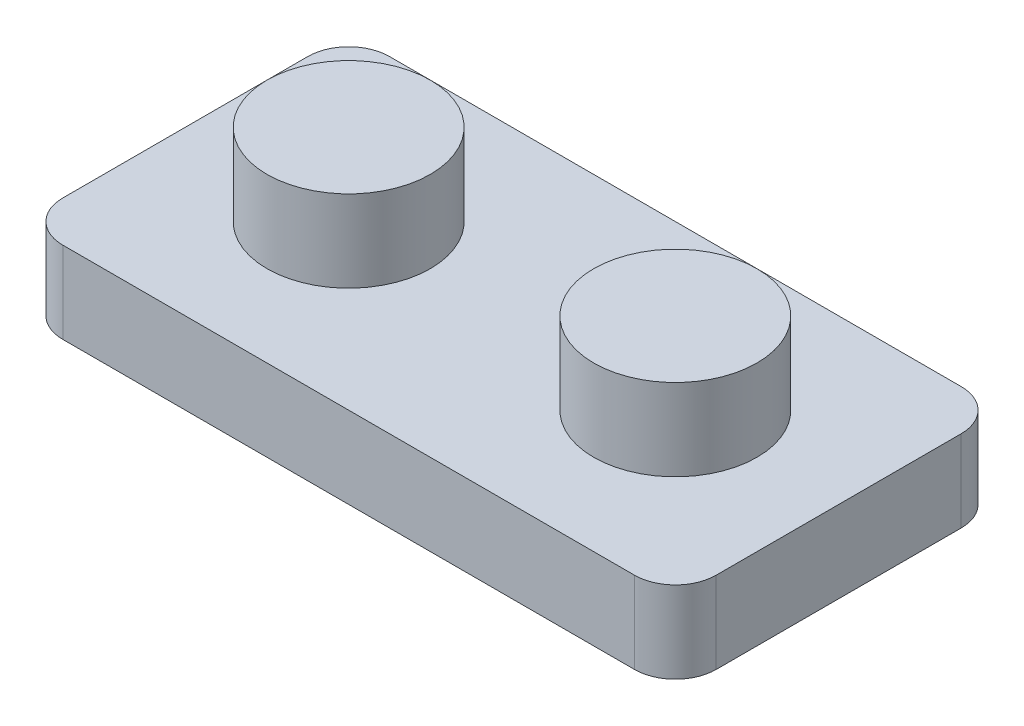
ISO-10303-21;
HEADER;
FILE_DESCRIPTION(('STEP AP214'),'2;1');
FILE_NAME('part.step','',(''),(''),'','','');
FILE_SCHEMA(('AUTOMOTIVE_DESIGN { 1 0 10303 214 1 1 1 1 }'));
ENDSEC;
DATA;
#1=APPLICATION_CONTEXT('core data for automotive mechanical design processes');
#2=APPLICATION_PROTOCOL_DEFINITION('international standard','automotive_design',2000,#1);
#3=PRODUCT_CONTEXT('',#1,'mechanical');
#4=PRODUCT('Part','Part','',(#3));
#5=PRODUCT_RELATED_PRODUCT_CATEGORY('part','',(#4));
#6=PRODUCT_DEFINITION_FORMATION('','',#4);
#7=PRODUCT_DEFINITION_CONTEXT('part definition',#1,'design');
#8=PRODUCT_DEFINITION('design','',#6,#7);
#9=PRODUCT_DEFINITION_SHAPE('','',#8);
#10=(LENGTH_UNIT() NAMED_UNIT(*) SI_UNIT(.MILLI.,.METRE.));
#11=(NAMED_UNIT(*) PLANE_ANGLE_UNIT() SI_UNIT($,.RADIAN.));
#12=(NAMED_UNIT(*) SI_UNIT($,.STERADIAN.) SOLID_ANGLE_UNIT());
#13=UNCERTAINTY_MEASURE_WITH_UNIT(LENGTH_MEASURE(1.E-05),#10,'distance_accuracy_value','');
#14=(GEOMETRIC_REPRESENTATION_CONTEXT(3) GLOBAL_UNCERTAINTY_ASSIGNED_CONTEXT((#13)) GLOBAL_UNIT_ASSIGNED_CONTEXT((#10,
#11,#12)) REPRESENTATION_CONTEXT('',''));
#15=CARTESIAN_POINT('',(0.,0.,0.));
#16=DIRECTION('',(0.,0.,1.));
#17=DIRECTION('',(1.,0.,0.));
#18=AXIS2_PLACEMENT_3D('',#15,#16,#17);
#19=CARTESIAN_POINT('',(0.,12.7,-50.8));
#20=DIRECTION('',(0.,-1.,0.));
#21=DIRECTION('',(0.,0.,-1.));
#22=AXIS2_PLACEMENT_3D('',#19,#20,#21);
#23=PLANE('',#22);
#24=CARTESIAN_POINT('',(25.4,12.7,-25.4));
#25=DIRECTION('',(0.,-1.,0.));
#26=DIRECTION('',(0.,0.,-1.));
#27=AXIS2_PLACEMENT_3D('',#24,#25,#26);
#28=CIRCLE('',#27,12.7);
#29=CARTESIAN_POINT('',(25.4,12.7,-38.1));
#30=VERTEX_POINT('',#29);
#31=EDGE_CURVE('E133',#30,#30,#28,.F.);
#32=ORIENTED_EDGE('',*,*,#31,.F.);
#33=EDGE_LOOP('',(#32));
#34=FACE_BOUND('',#33,.T.);
#35=DIRECTION('',(1.,0.,0.));
#36=VECTOR('',#35,1.);
#37=CARTESIAN_POINT('',(0.,12.7,0.));
#38=LINE('',#37,#36);
#39=CARTESIAN_POINT('',(6.35,12.7,0.));
#40=VERTEX_POINT('',#39);
#41=CARTESIAN_POINT('',(95.25,12.7,0.));
#42=VERTEX_POINT('',#41);
#43=EDGE_CURVE('E172',#40,#42,#38,.T.);
#44=ORIENTED_EDGE('',*,*,#43,.T.);
#45=CARTESIAN_POINT('',(95.25,12.7,-6.35));
#46=DIRECTION('',(0.,-1.,0.));
#47=DIRECTION('',(0.,0.,-1.));
#48=AXIS2_PLACEMENT_3D('',#45,#46,#47);
#49=CIRCLE('',#48,6.35);
#50=CARTESIAN_POINT('',(101.6,12.7,-6.35));
#51=VERTEX_POINT('',#50);
#52=EDGE_CURVE('E153',#42,#51,#49,.F.);
#53=ORIENTED_EDGE('',*,*,#52,.T.);
#54=DIRECTION('',(0.,0.,-1.));
#55=VECTOR('',#54,1.);
#56=CARTESIAN_POINT('',(101.6,12.7,0.));
#57=LINE('',#56,#55);
#58=CARTESIAN_POINT('',(101.6,12.7,-44.45));
#59=VERTEX_POINT('',#58);
#60=EDGE_CURVE('E118',#51,#59,#57,.T.);
#61=ORIENTED_EDGE('',*,*,#60,.T.);
#62=CARTESIAN_POINT('',(95.25,12.7,-44.45));
#63=DIRECTION('',(0.,-1.,0.));
#64=DIRECTION('',(0.,0.,-1.));
#65=AXIS2_PLACEMENT_3D('',#62,#63,#64);
#66=CIRCLE('',#65,6.35);
#67=CARTESIAN_POINT('',(95.25,12.7,-50.8));
#68=VERTEX_POINT('',#67);
#69=EDGE_CURVE('E54',#59,#68,#66,.F.);
#70=ORIENTED_EDGE('',*,*,#69,.T.);
#71=DIRECTION('',(-1.,0.,0.));
#72=VECTOR('',#71,1.);
#73=CARTESIAN_POINT('',(0.,12.7,-50.8));
#74=LINE('',#73,#72);
#75=CARTESIAN_POINT('',(6.35,12.7,-50.8));
#76=VERTEX_POINT('',#75);
#77=EDGE_CURVE('E137',#68,#76,#74,.T.);
#78=ORIENTED_EDGE('',*,*,#77,.T.);
#79=CARTESIAN_POINT('',(6.35,12.7,-44.45));
#80=DIRECTION('',(0.,-1.,0.));
#81=DIRECTION('',(0.,0.,-1.));
#82=AXIS2_PLACEMENT_3D('',#79,#80,#81);
#83=CIRCLE('',#82,6.35);
#84=CARTESIAN_POINT('',(0.,12.7,-44.45));
#85=VERTEX_POINT('',#84);
#86=EDGE_CURVE('E150',#76,#85,#83,.F.);
#87=ORIENTED_EDGE('',*,*,#86,.T.);
#88=DIRECTION('',(0.,0.,1.));
#89=VECTOR('',#88,1.);
#90=CARTESIAN_POINT('',(0.,12.7,0.));
#91=LINE('',#90,#89);
#92=CARTESIAN_POINT('',(0.,12.7,-6.35));
#93=VERTEX_POINT('',#92);
#94=EDGE_CURVE('E127',#85,#93,#91,.T.);
#95=ORIENTED_EDGE('',*,*,#94,.T.);
#96=CARTESIAN_POINT('',(6.35,12.7,-6.35));
#97=DIRECTION('',(0.,-1.,0.));
#98=DIRECTION('',(0.,0.,-1.));
#99=AXIS2_PLACEMENT_3D('',#96,#97,#98);
#100=CIRCLE('',#99,6.35);
#101=EDGE_CURVE('E148',#93,#40,#100,.F.);
#102=ORIENTED_EDGE('',*,*,#101,.T.);
#103=EDGE_LOOP('',(#44,#53,#61,#70,#78,#87,#95,#102));
#104=FACE_BOUND('',#103,.T.);
#105=CARTESIAN_POINT('',(76.2,12.7,-25.4));
#106=DIRECTION('',(0.,-1.,0.));
#107=DIRECTION('',(0.,0.,-1.));
#108=AXIS2_PLACEMENT_3D('',#105,#106,#107);
#109=CIRCLE('',#108,12.7);
#110=CARTESIAN_POINT('',(76.2,12.7,-38.1));
#111=VERTEX_POINT('',#110);
#112=EDGE_CURVE('E136',#111,#111,#109,.F.);
#113=ORIENTED_EDGE('',*,*,#112,.F.);
#114=EDGE_LOOP('',(#113));
#115=FACE_BOUND('',#114,.T.);
#116=ADVANCED_FACE('F32',(#34,#104,#115),#23,.F.);
#117=CARTESIAN_POINT('',(0.,12.7,0.));
#118=DIRECTION('',(1.,0.,0.));
#119=DIRECTION('',(0.,0.,-1.));
#120=AXIS2_PLACEMENT_3D('',#117,#118,#119);
#121=PLANE('',#120);
#122=ORIENTED_EDGE('',*,*,#94,.F.);
#123=DIRECTION('',(0.,-1.,0.));
#124=VECTOR('',#123,1.);
#125=CARTESIAN_POINT('',(0.,12.7,-44.45));
#126=LINE('',#125,#124);
#127=CARTESIAN_POINT('',(0.,0.,-44.45));
#128=VERTEX_POINT('',#127);
#129=EDGE_CURVE('E11',#85,#128,#126,.T.);
#130=ORIENTED_EDGE('',*,*,#129,.T.);
#131=DIRECTION('',(0.,0.,1.));
#132=VECTOR('',#131,1.);
#133=CARTESIAN_POINT('',(0.,0.,0.));
#134=LINE('',#133,#132);
#135=CARTESIAN_POINT('',(0.,0.,-6.35));
#136=VERTEX_POINT('',#135);
#137=EDGE_CURVE('E129',#128,#136,#134,.T.);
#138=ORIENTED_EDGE('',*,*,#137,.T.);
#139=DIRECTION('',(0.,-1.,0.));
#140=VECTOR('',#139,1.);
#141=CARTESIAN_POINT('',(0.,12.7,-6.35));
#142=LINE('',#141,#140);
#143=EDGE_CURVE('E40',#136,#93,#142,.F.);
#144=ORIENTED_EDGE('',*,*,#143,.T.);
#145=EDGE_LOOP('',(#122,#130,#138,#144));
#146=FACE_BOUND('',#145,.T.);
#147=ADVANCED_FACE('F163',(#146),#121,.F.);
#148=CARTESIAN_POINT('',(0.,12.7,0.));
#149=DIRECTION('',(0.,0.,-1.));
#150=DIRECTION('',(-1.,0.,0.));
#151=AXIS2_PLACEMENT_3D('',#148,#149,#150);
#152=PLANE('',#151);
#153=DIRECTION('',(1.,0.,0.));
#154=VECTOR('',#153,1.);
#155=CARTESIAN_POINT('',(0.,0.,0.));
#156=LINE('',#155,#154);
#157=CARTESIAN_POINT('',(6.35,0.,0.));
#158=VERTEX_POINT('',#157);
#159=CARTESIAN_POINT('',(95.25,0.,0.));
#160=VERTEX_POINT('',#159);
#161=EDGE_CURVE('E125',#158,#160,#156,.T.);
#162=ORIENTED_EDGE('',*,*,#161,.T.);
#163=DIRECTION('',(0.,-1.,0.));
#164=VECTOR('',#163,1.);
#165=CARTESIAN_POINT('',(95.25,12.7,0.));
#166=LINE('',#165,#164);
#167=EDGE_CURVE('E104',#160,#42,#166,.F.);
#168=ORIENTED_EDGE('',*,*,#167,.T.);
#169=ORIENTED_EDGE('',*,*,#43,.F.);
#170=DIRECTION('',(0.,-1.,0.));
#171=VECTOR('',#170,1.);
#172=CARTESIAN_POINT('',(6.35,12.7,0.));
#173=LINE('',#172,#171);
#174=EDGE_CURVE('E109',#40,#158,#173,.T.);
#175=ORIENTED_EDGE('',*,*,#174,.T.);
#176=EDGE_LOOP('',(#162,#168,#169,#175));
#177=FACE_BOUND('',#176,.T.);
#178=ADVANCED_FACE('F176',(#177),#152,.F.);
#179=CARTESIAN_POINT('',(101.6,12.7,0.));
#180=DIRECTION('',(-1.,0.,0.));
#181=DIRECTION('',(0.,0.,1.));
#182=AXIS2_PLACEMENT_3D('',#179,#180,#181);
#183=PLANE('',#182);
#184=ORIENTED_EDGE('',*,*,#60,.F.);
#185=DIRECTION('',(0.,-1.,0.));
#186=VECTOR('',#185,1.);
#187=CARTESIAN_POINT('',(101.6,12.7,-6.35));
#188=LINE('',#187,#186);
#189=CARTESIAN_POINT('',(101.6,0.,-6.35));
#190=VERTEX_POINT('',#189);
#191=EDGE_CURVE('E103',#51,#190,#188,.T.);
#192=ORIENTED_EDGE('',*,*,#191,.T.);
#193=DIRECTION('',(0.,0.,-1.));
#194=VECTOR('',#193,1.);
#195=CARTESIAN_POINT('',(101.6,0.,0.));
#196=LINE('',#195,#194);
#197=CARTESIAN_POINT('',(101.6,0.,-44.45));
#198=VERTEX_POINT('',#197);
#199=EDGE_CURVE('E116',#190,#198,#196,.T.);
#200=ORIENTED_EDGE('',*,*,#199,.T.);
#201=DIRECTION('',(0.,-1.,0.));
#202=VECTOR('',#201,1.);
#203=CARTESIAN_POINT('',(101.6,12.7,-44.45));
#204=LINE('',#203,#202);
#205=EDGE_CURVE('E120',#198,#59,#204,.F.);
#206=ORIENTED_EDGE('',*,*,#205,.T.);
#207=EDGE_LOOP('',(#184,#192,#200,#206));
#208=FACE_BOUND('',#207,.T.);
#209=ADVANCED_FACE('F115',(#208),#183,.F.);
#210=CARTESIAN_POINT('',(0.,12.7,-50.8));
#211=DIRECTION('',(0.,0.,1.));
#212=DIRECTION('',(1.,0.,0.));
#213=AXIS2_PLACEMENT_3D('',#210,#211,#212);
#214=PLANE('',#213);
#215=ORIENTED_EDGE('',*,*,#77,.F.);
#216=DIRECTION('',(0.,-1.,0.));
#217=VECTOR('',#216,1.);
#218=CARTESIAN_POINT('',(95.25,12.7,-50.8));
#219=LINE('',#218,#217);
#220=CARTESIAN_POINT('',(95.25,0.,-50.8));
#221=VERTEX_POINT('',#220);
#222=EDGE_CURVE('E156',#68,#221,#219,.T.);
#223=ORIENTED_EDGE('',*,*,#222,.T.);
#224=DIRECTION('',(-1.,0.,0.));
#225=VECTOR('',#224,1.);
#226=CARTESIAN_POINT('',(0.,0.,-50.8));
#227=LINE('',#226,#225);
#228=CARTESIAN_POINT('',(6.35,0.,-50.8));
#229=VERTEX_POINT('',#228);
#230=EDGE_CURVE('E124',#221,#229,#227,.T.);
#231=ORIENTED_EDGE('',*,*,#230,.T.);
#232=DIRECTION('',(0.,-1.,0.));
#233=VECTOR('',#232,1.);
#234=CARTESIAN_POINT('',(6.35,12.7,-50.8));
#235=LINE('',#234,#233);
#236=EDGE_CURVE('E47',#229,#76,#235,.F.);
#237=ORIENTED_EDGE('',*,*,#236,.T.);
#238=EDGE_LOOP('',(#215,#223,#231,#237));
#239=FACE_BOUND('',#238,.T.);
#240=ADVANCED_FACE('F210',(#239),#214,.F.);
#241=CARTESIAN_POINT('',(0.,0.,-50.8));
#242=DIRECTION('',(0.,-1.,0.));
#243=DIRECTION('',(0.,0.,-1.));
#244=AXIS2_PLACEMENT_3D('',#241,#242,#243);
#245=PLANE('',#244);
#246=ORIENTED_EDGE('',*,*,#199,.F.);
#247=CARTESIAN_POINT('',(95.25,0.,-6.35));
#248=DIRECTION('',(0.,-1.,0.));
#249=DIRECTION('',(0.,0.,-1.));
#250=AXIS2_PLACEMENT_3D('',#247,#248,#249);
#251=CIRCLE('',#250,6.35);
#252=EDGE_CURVE('E99',#190,#160,#251,.T.);
#253=ORIENTED_EDGE('',*,*,#252,.T.);
#254=ORIENTED_EDGE('',*,*,#161,.F.);
#255=CARTESIAN_POINT('',(6.35,0.,-6.35));
#256=DIRECTION('',(0.,-1.,0.));
#257=DIRECTION('',(0.,0.,-1.));
#258=AXIS2_PLACEMENT_3D('',#255,#256,#257);
#259=CIRCLE('',#258,6.35);
#260=EDGE_CURVE('E119',#158,#136,#259,.T.);
#261=ORIENTED_EDGE('',*,*,#260,.T.);
#262=ORIENTED_EDGE('',*,*,#137,.F.);
#263=CARTESIAN_POINT('',(6.35,0.,-44.45));
#264=DIRECTION('',(0.,-1.,0.));
#265=DIRECTION('',(0.,0.,-1.));
#266=AXIS2_PLACEMENT_3D('',#263,#264,#265);
#267=CIRCLE('',#266,6.35);
#268=EDGE_CURVE('E142',#128,#229,#267,.T.);
#269=ORIENTED_EDGE('',*,*,#268,.T.);
#270=ORIENTED_EDGE('',*,*,#230,.F.);
#271=CARTESIAN_POINT('',(95.25,0.,-44.45));
#272=DIRECTION('',(0.,-1.,0.));
#273=DIRECTION('',(0.,0.,-1.));
#274=AXIS2_PLACEMENT_3D('',#271,#272,#273);
#275=CIRCLE('',#274,6.35);
#276=EDGE_CURVE('E110',#221,#198,#275,.T.);
#277=ORIENTED_EDGE('',*,*,#276,.T.);
#278=EDGE_LOOP('',(#246,#253,#254,#261,#262,#269,#270,#277));
#279=FACE_BOUND('',#278,.T.);
#280=ADVANCED_FACE('F122',(#279),#245,.T.);
#281=CARTESIAN_POINT('',(25.4,25.4,-25.4));
#282=DIRECTION('',(0.,-1.,0.));
#283=DIRECTION('',(0.,0.,-1.));
#284=AXIS2_PLACEMENT_3D('',#281,#282,#283);
#285=CYLINDRICAL_SURFACE('',#284,12.7);
#286=CARTESIAN_POINT('',(25.4,25.4,-25.4));
#287=DIRECTION('',(0.,1.,0.));
#288=DIRECTION('',(0.,0.,1.));
#289=AXIS2_PLACEMENT_3D('',#286,#287,#288);
#290=CIRCLE('',#289,12.7);
#291=CARTESIAN_POINT('',(25.4,25.4,-12.7));
#292=VERTEX_POINT('',#291);
#293=EDGE_CURVE('E177',#292,#292,#290,.T.);
#294=ORIENTED_EDGE('',*,*,#293,.F.);
#295=EDGE_LOOP('',(#294));
#296=FACE_BOUND('',#295,.T.);
#297=ORIENTED_EDGE('',*,*,#31,.T.);
#298=EDGE_LOOP('',(#297));
#299=FACE_BOUND('',#298,.T.);
#300=ADVANCED_FACE('F206',(#296,#299),#285,.T.);
#301=CARTESIAN_POINT('',(25.4,25.4,-25.4));
#302=DIRECTION('',(0.,1.,0.));
#303=DIRECTION('',(0.,0.,1.));
#304=AXIS2_PLACEMENT_3D('',#301,#302,#303);
#305=PLANE('',#304);
#306=ORIENTED_EDGE('',*,*,#293,.T.);
#307=EDGE_LOOP('',(#306));
#308=FACE_BOUND('',#307,.T.);
#309=ADVANCED_FACE('F193',(#308),#305,.T.);
#310=CARTESIAN_POINT('',(76.2,25.4,-25.4));
#311=DIRECTION('',(0.,-1.,0.));
#312=DIRECTION('',(0.,0.,-1.));
#313=AXIS2_PLACEMENT_3D('',#310,#311,#312);
#314=CYLINDRICAL_SURFACE('',#313,12.7);
#315=CARTESIAN_POINT('',(76.2,25.4,-25.4));
#316=DIRECTION('',(0.,1.,0.));
#317=DIRECTION('',(0.,0.,-1.));
#318=AXIS2_PLACEMENT_3D('',#315,#316,#317);
#319=CIRCLE('',#318,12.7);
#320=CARTESIAN_POINT('',(76.2,25.4,-38.1));
#321=VERTEX_POINT('',#320);
#322=EDGE_CURVE('E179',#321,#321,#319,.T.);
#323=ORIENTED_EDGE('',*,*,#322,.F.);
#324=EDGE_LOOP('',(#323));
#325=FACE_BOUND('',#324,.T.);
#326=ORIENTED_EDGE('',*,*,#112,.T.);
#327=EDGE_LOOP('',(#326));
#328=FACE_BOUND('',#327,.T.);
#329=ADVANCED_FACE('F190',(#325,#328),#314,.T.);
#330=CARTESIAN_POINT('',(76.2,25.4,-25.4));
#331=DIRECTION('',(0.,-1.,0.));
#332=DIRECTION('',(0.,0.,-1.));
#333=AXIS2_PLACEMENT_3D('',#330,#331,#332);
#334=PLANE('',#333);
#335=ORIENTED_EDGE('',*,*,#322,.T.);
#336=EDGE_LOOP('',(#335));
#337=FACE_BOUND('',#336,.T.);
#338=ADVANCED_FACE('F188',(#337),#334,.F.);
#339=CARTESIAN_POINT('',(95.25,12.7,-6.35));
#340=DIRECTION('',(0.,-1.,0.));
#341=DIRECTION('',(0.,0.,-1.));
#342=AXIS2_PLACEMENT_3D('',#339,#340,#341);
#343=CYLINDRICAL_SURFACE('',#342,6.35);
#344=ORIENTED_EDGE('',*,*,#52,.F.);
#345=ORIENTED_EDGE('',*,*,#167,.F.);
#346=ORIENTED_EDGE('',*,*,#252,.F.);
#347=ORIENTED_EDGE('',*,*,#191,.F.);
#348=EDGE_LOOP('',(#344,#345,#346,#347));
#349=FACE_BOUND('',#348,.T.);
#350=ADVANCED_FACE('F102',(#349),#343,.T.);
#351=CARTESIAN_POINT('',(95.25,12.7,-44.45));
#352=DIRECTION('',(0.,-1.,0.));
#353=DIRECTION('',(0.,0.,-1.));
#354=AXIS2_PLACEMENT_3D('',#351,#352,#353);
#355=CYLINDRICAL_SURFACE('',#354,6.35);
#356=ORIENTED_EDGE('',*,*,#69,.F.);
#357=ORIENTED_EDGE('',*,*,#205,.F.);
#358=ORIENTED_EDGE('',*,*,#276,.F.);
#359=ORIENTED_EDGE('',*,*,#222,.F.);
#360=EDGE_LOOP('',(#356,#357,#358,#359));
#361=FACE_BOUND('',#360,.T.);
#362=ADVANCED_FACE('F219',(#361),#355,.T.);
#363=CARTESIAN_POINT('',(6.35,12.7,-44.45));
#364=DIRECTION('',(0.,-1.,0.));
#365=DIRECTION('',(0.,0.,-1.));
#366=AXIS2_PLACEMENT_3D('',#363,#364,#365);
#367=CYLINDRICAL_SURFACE('',#366,6.35);
#368=ORIENTED_EDGE('',*,*,#86,.F.);
#369=ORIENTED_EDGE('',*,*,#236,.F.);
#370=ORIENTED_EDGE('',*,*,#268,.F.);
#371=ORIENTED_EDGE('',*,*,#129,.F.);
#372=EDGE_LOOP('',(#368,#369,#370,#371));
#373=FACE_BOUND('',#372,.T.);
#374=ADVANCED_FACE('F221',(#373),#367,.T.);
#375=CARTESIAN_POINT('',(6.35,12.7,-6.35));
#376=DIRECTION('',(0.,-1.,0.));
#377=DIRECTION('',(0.,0.,-1.));
#378=AXIS2_PLACEMENT_3D('',#375,#376,#377);
#379=CYLINDRICAL_SURFACE('',#378,6.35);
#380=ORIENTED_EDGE('',*,*,#101,.F.);
#381=ORIENTED_EDGE('',*,*,#143,.F.);
#382=ORIENTED_EDGE('',*,*,#260,.F.);
#383=ORIENTED_EDGE('',*,*,#174,.F.);
#384=EDGE_LOOP('',(#380,#381,#382,#383));
#385=FACE_BOUND('',#384,.T.);
#386=ADVANCED_FACE('F34',(#385),#379,.T.);
#387=CLOSED_SHELL('',(#116,#147,#178,#209,#240,#280,#300,#309,#329,#338,#350,#362,#374,#386));
#388=MANIFOLD_SOLID_BREP('B2',#387);
#389=ADVANCED_BREP_SHAPE_REPRESENTATION('',(#18,#388),#14);
#390=SHAPE_DEFINITION_REPRESENTATION(#9,#389);
ENDSEC;
END-ISO-10303-21;
